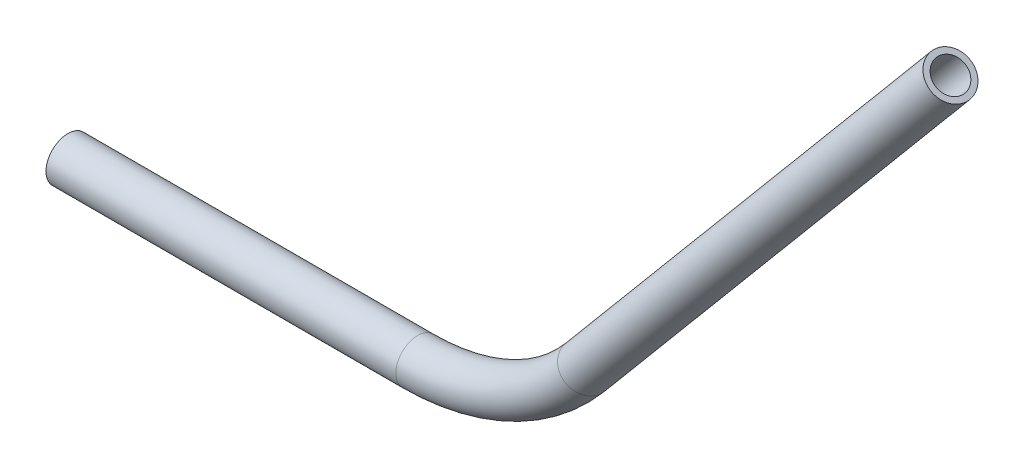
ISO-10303-21;
HEADER;
FILE_DESCRIPTION(('STEP AP214'),'2;1');
FILE_NAME('part.step','',(''),(''),'','','');
FILE_SCHEMA(('AUTOMOTIVE_DESIGN { 1 0 10303 214 1 1 1 1 }'));
ENDSEC;
DATA;
#1=APPLICATION_CONTEXT('core data for automotive mechanical design processes');
#2=APPLICATION_PROTOCOL_DEFINITION('international standard','automotive_design',2000,#1);
#3=PRODUCT_CONTEXT('',#1,'mechanical');
#4=PRODUCT('Part','Part','',(#3));
#5=PRODUCT_RELATED_PRODUCT_CATEGORY('part','',(#4));
#6=PRODUCT_DEFINITION_FORMATION('','',#4);
#7=PRODUCT_DEFINITION_CONTEXT('part definition',#1,'design');
#8=PRODUCT_DEFINITION('design','',#6,#7);
#9=PRODUCT_DEFINITION_SHAPE('','',#8);
#10=(LENGTH_UNIT() NAMED_UNIT(*) SI_UNIT(.MILLI.,.METRE.));
#11=(NAMED_UNIT(*) PLANE_ANGLE_UNIT() SI_UNIT($,.RADIAN.));
#12=(NAMED_UNIT(*) SI_UNIT($,.STERADIAN.) SOLID_ANGLE_UNIT());
#13=UNCERTAINTY_MEASURE_WITH_UNIT(LENGTH_MEASURE(1.E-05),#10,'distance_accuracy_value','');
#14=(GEOMETRIC_REPRESENTATION_CONTEXT(3) GLOBAL_UNCERTAINTY_ASSIGNED_CONTEXT((#13)) GLOBAL_UNIT_ASSIGNED_CONTEXT((#10,
#11,#12)) REPRESENTATION_CONTEXT('',''));
#15=CARTESIAN_POINT('',(0.,0.,0.));
#16=DIRECTION('',(0.,0.,1.));
#17=DIRECTION('',(1.,0.,0.));
#18=AXIS2_PLACEMENT_3D('',#15,#16,#17);
#19=CARTESIAN_POINT('',(150.243822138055,22.6829867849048,0.));
#20=DIRECTION('',(0.642787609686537,0.76604444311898,0.));
#21=DIRECTION('',(-0.76604444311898,0.642787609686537,0.));
#22=AXIS2_PLACEMENT_3D('',#19,#20,#21);
#23=CYLINDRICAL_SURFACE('',#22,6.35);
#24=CARTESIAN_POINT('',(150.243822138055,22.6829867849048,0.));
#25=DIRECTION('',(0.642787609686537,0.76604444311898,0.));
#26=DIRECTION('',(0.,0.,-1.));
#27=AXIS2_PLACEMENT_3D('',#24,#25,#26);
#28=CIRCLE('',#27,6.35);
#29=CARTESIAN_POINT('',(155.108204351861,18.6012854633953,0.));
#30=VERTEX_POINT('',#29);
#31=EDGE_CURVE('E51',#30,#30,#28,.T.);
#32=ORIENTED_EDGE('',*,*,#31,.T.);
#33=EDGE_LOOP('',(#32));
#34=FACE_BOUND('',#33,.T.);
#35=CARTESIAN_POINT('',(256.368056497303,149.156924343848,0.));
#36=DIRECTION('',(0.642787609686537,0.76604444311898,0.));
#37=DIRECTION('',(0.,0.,-1.));
#38=AXIS2_PLACEMENT_3D('',#35,#36,#37);
#39=CIRCLE('',#38,6.35);
#40=CARTESIAN_POINT('',(256.368056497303,149.156924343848,-6.35));
#41=VERTEX_POINT('',#40);
#42=EDGE_CURVE('E12',#41,#41,#39,.T.);
#43=ORIENTED_EDGE('',*,*,#42,.F.);
#44=EDGE_LOOP('',(#43));
#45=FACE_BOUND('',#44,.T.);
#46=ADVANCED_FACE('F45',(#34,#45),#23,.T.);
#47=CARTESIAN_POINT('',(101.6,63.5,0.));
#48=DIRECTION('',(0.,0.,1.));
#49=DIRECTION('',(1.,0.,0.));
#50=AXIS2_PLACEMENT_3D('',#47,#48,#49);
#51=TOROIDAL_SURFACE('',#50,63.5,6.35);
#52=CARTESIAN_POINT('',(101.6,0.,0.));
#53=DIRECTION('',(1.,0.,0.));
#54=DIRECTION('',(0.,0.,-1.));
#55=AXIS2_PLACEMENT_3D('',#52,#53,#54);
#56=CIRCLE('',#55,6.35);
#57=CARTESIAN_POINT('',(101.6,-6.35000000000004,0.));
#58=VERTEX_POINT('',#57);
#59=EDGE_CURVE('E55',#58,#58,#56,.T.);
#60=CARTESIAN_POINT('',(101.6,63.5,0.));
#61=DIRECTION('',(0.,0.,1.));
#62=DIRECTION('',(1.,0.,0.));
#63=AXIS2_PLACEMENT_3D('',#60,#61,#62);
#64=CIRCLE('',#63,69.85);
#65=EDGE_CURVE('',#58,#30,#64,.T.);
#66=ORIENTED_EDGE('',*,*,#59,.T.);
#67=ORIENTED_EDGE('',*,*,#31,.F.);
#68=ORIENTED_EDGE('',*,*,#65,.T.);
#69=ORIENTED_EDGE('',*,*,#65,.F.);
#70=EDGE_LOOP('',(#66,#68,#67,#69));
#71=FACE_BOUND('',#70,.T.);
#72=ADVANCED_FACE('F96',(#71),#51,.T.);
#73=CARTESIAN_POINT('',(101.6,0.,0.));
#74=DIRECTION('',(-1.,0.,0.));
#75=DIRECTION('',(0.,-1.,0.));
#76=AXIS2_PLACEMENT_3D('',#73,#74,#75);
#77=CYLINDRICAL_SURFACE('',#76,6.35);
#78=ORIENTED_EDGE('',*,*,#59,.F.);
#79=EDGE_LOOP('',(#78));
#80=FACE_BOUND('',#79,.T.);
#81=CARTESIAN_POINT('',(0.,0.,0.));
#82=DIRECTION('',(1.,0.,0.));
#83=DIRECTION('',(0.,0.,-1.));
#84=AXIS2_PLACEMENT_3D('',#81,#82,#83);
#85=CIRCLE('',#84,6.35);
#86=CARTESIAN_POINT('',(0.,0.,-6.35));
#87=VERTEX_POINT('',#86);
#88=EDGE_CURVE('E59',#87,#87,#85,.T.);
#89=ORIENTED_EDGE('',*,*,#88,.T.);
#90=EDGE_LOOP('',(#89));
#91=FACE_BOUND('',#90,.T.);
#92=ADVANCED_FACE('F88',(#80,#91),#77,.T.);
#93=CARTESIAN_POINT('',(256.368056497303,149.156924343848,0.));
#94=DIRECTION('',(0.642787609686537,0.76604444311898,0.));
#95=DIRECTION('',(0.,0.,-1.));
#96=AXIS2_PLACEMENT_3D('',#93,#94,#95);
#97=PLANE('',#96);
#98=CARTESIAN_POINT('',(256.368056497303,149.156924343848,0.));
#99=DIRECTION('',(0.642787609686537,0.76604444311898,0.));
#100=DIRECTION('',(-0.76604444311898,0.642787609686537,0.));
#101=AXIS2_PLACEMENT_3D('',#98,#99,#100);
#102=CIRCLE('',#101,4.699);
#103=CARTESIAN_POINT('',(252.768413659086,152.177383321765,0.));
#104=VERTEX_POINT('',#103);
#105=EDGE_CURVE('E63',#104,#104,#102,.T.);
#106=ORIENTED_EDGE('',*,*,#105,.F.);
#107=EDGE_LOOP('',(#106));
#108=FACE_BOUND('',#107,.T.);
#109=ORIENTED_EDGE('',*,*,#42,.T.);
#110=EDGE_LOOP('',(#109));
#111=FACE_BOUND('',#110,.T.);
#112=ADVANCED_FACE('F86',(#108,#111),#97,.T.);
#113=CARTESIAN_POINT('',(0.,0.,0.));
#114=DIRECTION('',(1.,0.,0.));
#115=DIRECTION('',(0.,0.,-1.));
#116=AXIS2_PLACEMENT_3D('',#113,#114,#115);
#117=PLANE('',#116);
#118=CARTESIAN_POINT('',(0.,0.,0.));
#119=DIRECTION('',(1.,0.,0.));
#120=DIRECTION('',(0.,0.,-1.));
#121=AXIS2_PLACEMENT_3D('',#118,#119,#120);
#122=CIRCLE('',#121,4.699);
#123=CARTESIAN_POINT('',(0.,0.,-4.699));
#124=VERTEX_POINT('',#123);
#125=EDGE_CURVE('E65',#124,#124,#122,.T.);
#126=ORIENTED_EDGE('',*,*,#125,.T.);
#127=EDGE_LOOP('',(#126));
#128=FACE_BOUND('',#127,.T.);
#129=ORIENTED_EDGE('',*,*,#88,.F.);
#130=EDGE_LOOP('',(#129));
#131=FACE_BOUND('',#130,.T.);
#132=ADVANCED_FACE('F82',(#128,#131),#117,.F.);
#133=CARTESIAN_POINT('',(150.243822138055,22.6829867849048,0.));
#134=DIRECTION('',(0.642787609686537,0.76604444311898,0.));
#135=DIRECTION('',(-0.76604444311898,0.642787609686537,0.));
#136=AXIS2_PLACEMENT_3D('',#133,#134,#135);
#137=CYLINDRICAL_SURFACE('',#136,4.699);
#138=CARTESIAN_POINT('',(150.243822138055,22.6829867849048,0.));
#139=DIRECTION('',(0.642787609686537,0.76604444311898,0.));
#140=DIRECTION('',(-0.76604444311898,0.642787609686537,0.));
#141=AXIS2_PLACEMENT_3D('',#138,#139,#140);
#142=CIRCLE('',#141,4.699);
#143=CARTESIAN_POINT('',(153.843464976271,19.6625278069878,0.));
#144=VERTEX_POINT('',#143);
#145=EDGE_CURVE('E71',#144,#144,#142,.T.);
#146=ORIENTED_EDGE('',*,*,#145,.F.);
#147=EDGE_LOOP('',(#146));
#148=FACE_BOUND('',#147,.T.);
#149=ORIENTED_EDGE('',*,*,#105,.T.);
#150=EDGE_LOOP('',(#149));
#151=FACE_BOUND('',#150,.T.);
#152=ADVANCED_FACE('F79',(#148,#151),#137,.F.);
#153=CARTESIAN_POINT('',(101.6,63.5,0.));
#154=DIRECTION('',(0.,0.,1.));
#155=DIRECTION('',(1.,0.,0.));
#156=AXIS2_PLACEMENT_3D('',#153,#154,#155);
#157=TOROIDAL_SURFACE('',#156,63.5,4.699);
#158=CARTESIAN_POINT('',(101.6,0.,0.));
#159=DIRECTION('',(-1.,0.,0.));
#160=DIRECTION('',(0.,-1.,0.));
#161=AXIS2_PLACEMENT_3D('',#158,#159,#160);
#162=CIRCLE('',#161,4.699);
#163=CARTESIAN_POINT('',(101.6,-4.69900000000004,0.));
#164=VERTEX_POINT('',#163);
#165=EDGE_CURVE('E68',#164,#164,#162,.F.);
#166=CARTESIAN_POINT('',(101.6,63.5,0.));
#167=DIRECTION('',(0.,0.,1.));
#168=DIRECTION('',(1.,0.,0.));
#169=AXIS2_PLACEMENT_3D('',#166,#167,#168);
#170=CIRCLE('',#169,68.199);
#171=EDGE_CURVE('',#164,#144,#170,.T.);
#172=ORIENTED_EDGE('',*,*,#165,.F.);
#173=ORIENTED_EDGE('',*,*,#145,.T.);
#174=ORIENTED_EDGE('',*,*,#171,.T.);
#175=ORIENTED_EDGE('',*,*,#171,.F.);
#176=EDGE_LOOP('',(#172,#174,#173,#175));
#177=FACE_BOUND('',#176,.T.);
#178=ADVANCED_FACE('F77',(#177),#157,.F.);
#179=CARTESIAN_POINT('',(101.6,0.,0.));
#180=DIRECTION('',(-1.,0.,0.));
#181=DIRECTION('',(0.,-1.,0.));
#182=AXIS2_PLACEMENT_3D('',#179,#180,#181);
#183=CYLINDRICAL_SURFACE('',#182,4.699);
#184=ORIENTED_EDGE('',*,*,#165,.T.);
#185=EDGE_LOOP('',(#184));
#186=FACE_BOUND('',#185,.T.);
#187=ORIENTED_EDGE('',*,*,#125,.F.);
#188=EDGE_LOOP('',(#187));
#189=FACE_BOUND('',#188,.T.);
#190=ADVANCED_FACE('F142',(#186,#189),#183,.F.);
#191=CLOSED_SHELL('',(#46,#72,#92,#112,#132,#152,#178,#190));
#192=MANIFOLD_SOLID_BREP('B2',#191);
#193=ADVANCED_BREP_SHAPE_REPRESENTATION('',(#18,#192),#14);
#194=SHAPE_DEFINITION_REPRESENTATION(#9,#193);
ENDSEC;
END-ISO-10303-21;
